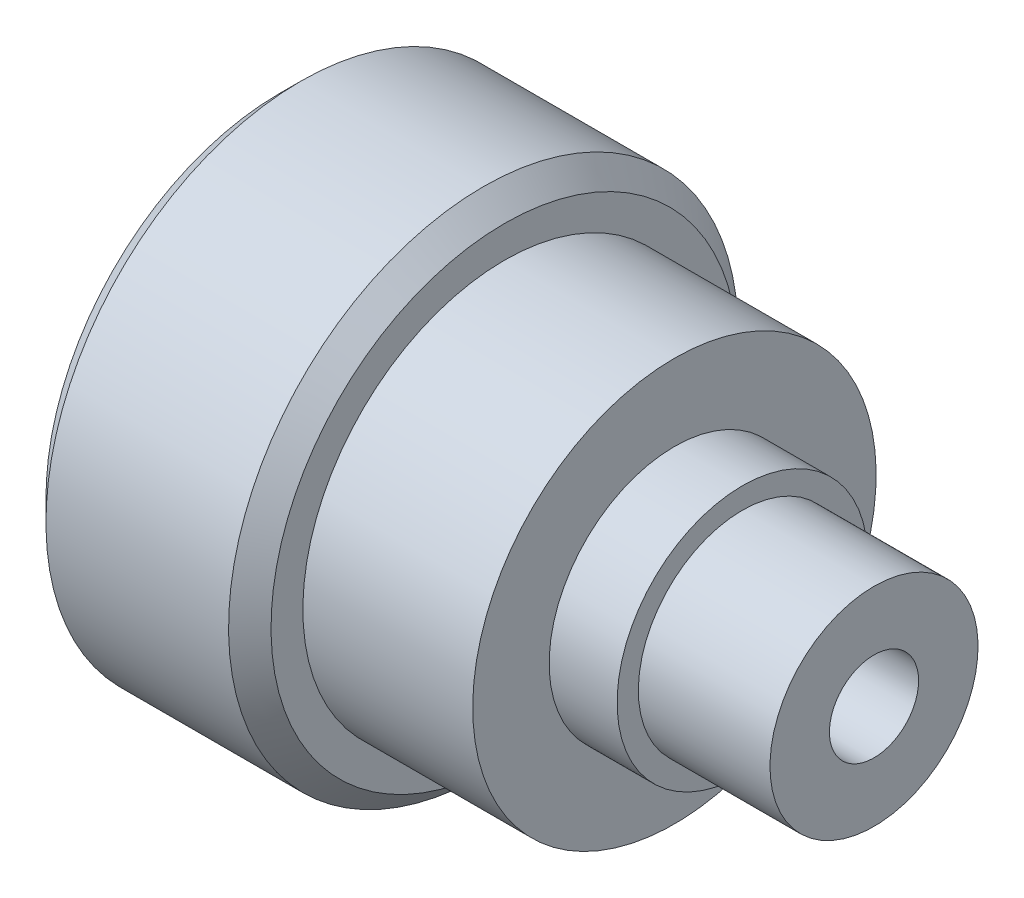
from build123d import *

# Parameters (mm, degrees)
M5_TAPPED_HOLE1_D     = 4.2
M5_TAPPED_HOLE1_DEPTH = 9.4
M5_TAPPED_HOLE1_TIP   = 1.2618073


with BuildPart() as part:
    # Sketch1 → Revolve1 (revolve)
    with BuildSketch(Plane.XY):
        Polygon((0, 2.5), (0, 11), (1, 12), (9.6, 12), (10.6, 11), (10.6, 9.5), (18.6, 9.5), (18.6, 5.9), (21.8, 5.9), (21.8, 4.9), (28, 4.9), (28, 0), (18.6, 0), (18.6, 2.5), align=None)
    revolve(axis=Axis((28, 0, 0), (-1, 0, 0)))

    # M5 Tapped Hole1
    with Locations(Plane.YZ.offset(28)):
        with Locations((0, 0)):
            Hole(M5_TAPPED_HOLE1_D / 2, depth=M5_TAPPED_HOLE1_DEPTH)
            with Locations((0, 0, -(M5_TAPPED_HOLE1_DEPTH + M5_TAPPED_HOLE1_TIP / 2))):  # 118° drill point
                Cone(0, M5_TAPPED_HOLE1_D / 2, M5_TAPPED_HOLE1_TIP, mode=Mode.SUBTRACT)


solid = part.part
